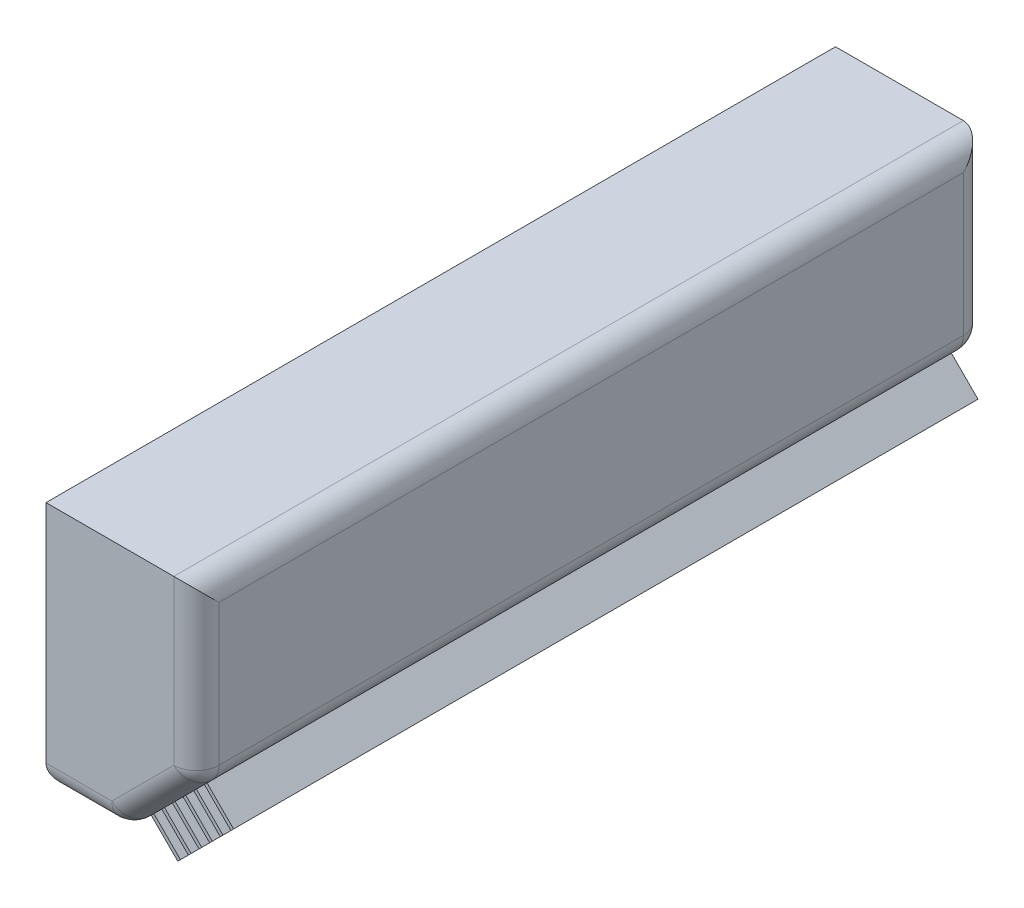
from build123d import *

# Parameters (mm, degrees)
EXTRUDE1_DEPTH = 1050
FILLET2_R      = 30
SKETCH3_W      = 5
SKETCH3_H      = 990
EXTRUDE2_DEPTH = 50


with BuildPart() as part:
    # Sketch1 → Extrude1 (new body)
    with BuildSketch(Plane.XY):
        Polygon((-200, 115), (0, 115), (0, -115), (-100, -215), (-200, -215), align=None)
    extrude(amount=EXTRUDE1_DEPTH)

    # Fillet2
    fillet2_edges = [part.edges().sort_by_distance(p)[0] for p in [
        (-50, -165, 1050),
        (0, 0, 1050),
        (0, 0, 0),
        (-50, -165, 0),
        (-150, -215, 0),
        (-150, -215, 1050),
        (0, 115, 525),
        (0, -115, 525),
        (-100, -215, 525),
        (-200, -215, 525),
    ]]
    fillet(fillet2_edges, radius=FILLET2_R)

    # Sketch3 → Extrude2 (add)
    with BuildSketch(Plane(origin=(57.5, -57.5, 0), x_dir=(0.7071067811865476, 0.7071067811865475, 0), z_dir=(0.7071067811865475, -0.7071067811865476, 0))):
        with Locations((-106.243686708, 525)):
            Rectangle(SKETCH3_W, SKETCH3_H)
        with Locations((-126.243686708, 525)):
            Rectangle(SKETCH3_W, SKETCH3_H)
        with Locations((-146.243686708, 525)):
            Rectangle(SKETCH3_W, SKETCH3_H)
        with Locations((-166.243686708, 525)):
            Rectangle(SKETCH3_W, SKETCH3_H)
        with Locations((-186.243686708, 525)):
            Rectangle(SKETCH3_W, SKETCH3_H)
        with Locations((-206.243686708, 525)):
            Rectangle(SKETCH3_W, SKETCH3_H)
    extrude(amount=EXTRUDE2_DEPTH)


solid = part.part
